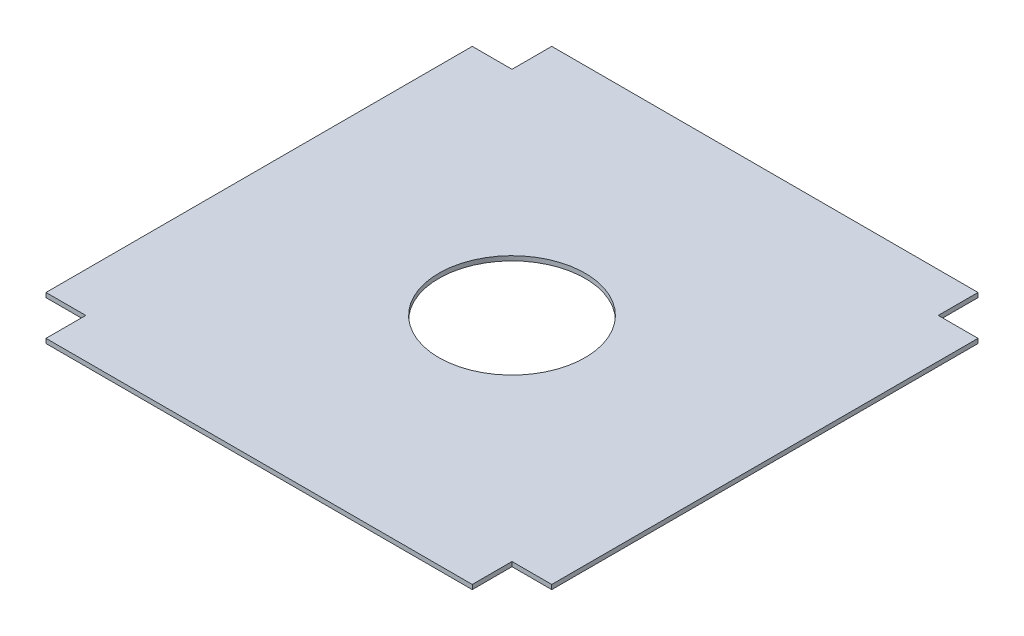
ISO-10303-21;
HEADER;
FILE_DESCRIPTION(('STEP AP214'),'2;1');
FILE_NAME('part.step','',(''),(''),'','','');
FILE_SCHEMA(('AUTOMOTIVE_DESIGN { 1 0 10303 214 1 1 1 1 }'));
ENDSEC;
DATA;
#1=APPLICATION_CONTEXT('core data for automotive mechanical design processes');
#2=APPLICATION_PROTOCOL_DEFINITION('international standard','automotive_design',2000,#1);
#3=PRODUCT_CONTEXT('',#1,'mechanical');
#4=PRODUCT('Part','Part','',(#3));
#5=PRODUCT_RELATED_PRODUCT_CATEGORY('part','',(#4));
#6=PRODUCT_DEFINITION_FORMATION('','',#4);
#7=PRODUCT_DEFINITION_CONTEXT('part definition',#1,'design');
#8=PRODUCT_DEFINITION('design','',#6,#7);
#9=PRODUCT_DEFINITION_SHAPE('','',#8);
#10=(LENGTH_UNIT() NAMED_UNIT(*) SI_UNIT(.MILLI.,.METRE.));
#11=(NAMED_UNIT(*) PLANE_ANGLE_UNIT() SI_UNIT($,.RADIAN.));
#12=(NAMED_UNIT(*) SI_UNIT($,.STERADIAN.) SOLID_ANGLE_UNIT());
#13=UNCERTAINTY_MEASURE_WITH_UNIT(LENGTH_MEASURE(1.E-05),#10,'distance_accuracy_value','');
#14=(GEOMETRIC_REPRESENTATION_CONTEXT(3) GLOBAL_UNCERTAINTY_ASSIGNED_CONTEXT((#13)) GLOBAL_UNIT_ASSIGNED_CONTEXT((#10,
#11,#12)) REPRESENTATION_CONTEXT('',''));
#15=CARTESIAN_POINT('',(0.,0.,0.));
#16=DIRECTION('',(0.,0.,1.));
#17=DIRECTION('',(1.,0.,0.));
#18=AXIS2_PLACEMENT_3D('',#15,#16,#17);
#19=CARTESIAN_POINT('',(-177.8,3.175,0.));
#20=DIRECTION('',(1.,0.,0.));
#21=DIRECTION('',(0.,0.,-1.));
#22=AXIS2_PLACEMENT_3D('',#19,#20,#21);
#23=PLANE('',#22);
#24=DIRECTION('',(0.,0.,1.));
#25=VECTOR('',#24,1.);
#26=CARTESIAN_POINT('',(-177.8,0.,0.));
#27=LINE('',#26,#25);
#28=CARTESIAN_POINT('',(-177.8,0.,-149.86));
#29=VERTEX_POINT('',#28);
#30=CARTESIAN_POINT('',(-177.8,0.,149.86));
#31=VERTEX_POINT('',#30);
#32=EDGE_CURVE('E160',#29,#31,#27,.T.);
#33=ORIENTED_EDGE('',*,*,#32,.T.);
#34=DIRECTION('',(0.,-1.,0.));
#35=VECTOR('',#34,1.);
#36=CARTESIAN_POINT('',(-177.8,3.175,149.86));
#37=LINE('',#36,#35);
#38=CARTESIAN_POINT('',(-177.8,3.175,149.86));
#39=VERTEX_POINT('',#38);
#40=EDGE_CURVE('E11',#39,#31,#37,.T.);
#41=ORIENTED_EDGE('',*,*,#40,.F.);
#42=DIRECTION('',(0.,0.,1.));
#43=VECTOR('',#42,1.);
#44=CARTESIAN_POINT('',(-177.8,3.175,0.));
#45=LINE('',#44,#43);
#46=CARTESIAN_POINT('',(-177.8,3.175,-149.86));
#47=VERTEX_POINT('',#46);
#48=EDGE_CURVE('E378',#47,#39,#45,.T.);
#49=ORIENTED_EDGE('',*,*,#48,.F.);
#50=DIRECTION('',(0.,-1.,0.));
#51=VECTOR('',#50,1.);
#52=CARTESIAN_POINT('',(-177.8,3.175,-149.86));
#53=LINE('',#52,#51);
#54=EDGE_CURVE('E51',#47,#29,#53,.T.);
#55=ORIENTED_EDGE('',*,*,#54,.T.);
#56=EDGE_LOOP('',(#33,#41,#49,#55));
#57=FACE_BOUND('',#56,.T.);
#58=ADVANCED_FACE('F34',(#57),#23,.F.);
#59=CARTESIAN_POINT('',(0.,3.175,149.86));
#60=DIRECTION('',(0.,0.,-1.));
#61=DIRECTION('',(-1.,0.,0.));
#62=AXIS2_PLACEMENT_3D('',#59,#60,#61);
#63=PLANE('',#62);
#64=DIRECTION('',(1.,0.,0.));
#65=VECTOR('',#64,1.);
#66=CARTESIAN_POINT('',(0.,0.,149.86));
#67=LINE('',#66,#65);
#68=CARTESIAN_POINT('',(-149.86,0.,149.86));
#69=VERTEX_POINT('',#68);
#70=EDGE_CURVE('E162',#31,#69,#67,.T.);
#71=ORIENTED_EDGE('',*,*,#70,.T.);
#72=DIRECTION('',(0.,-1.,0.));
#73=VECTOR('',#72,1.);
#74=CARTESIAN_POINT('',(-149.86,3.175,149.86));
#75=LINE('',#74,#73);
#76=CARTESIAN_POINT('',(-149.86,3.175,149.86));
#77=VERTEX_POINT('',#76);
#78=EDGE_CURVE('E43',#77,#69,#75,.T.);
#79=ORIENTED_EDGE('',*,*,#78,.F.);
#80=DIRECTION('',(1.,0.,0.));
#81=VECTOR('',#80,1.);
#82=CARTESIAN_POINT('',(0.,3.175,149.86));
#83=LINE('',#82,#81);
#84=EDGE_CURVE('E102',#39,#77,#83,.T.);
#85=ORIENTED_EDGE('',*,*,#84,.F.);
#86=ORIENTED_EDGE('',*,*,#40,.T.);
#87=EDGE_LOOP('',(#71,#79,#85,#86));
#88=FACE_BOUND('',#87,.T.);
#89=ADVANCED_FACE('F213',(#88),#63,.F.);
#90=CARTESIAN_POINT('',(-149.86,3.175,0.));
#91=DIRECTION('',(-1.,0.,0.));
#92=DIRECTION('',(0.,0.,1.));
#93=AXIS2_PLACEMENT_3D('',#90,#91,#92);
#94=PLANE('',#93);
#95=DIRECTION('',(0.,0.,-1.));
#96=VECTOR('',#95,1.);
#97=CARTESIAN_POINT('',(-149.86,0.,0.));
#98=LINE('',#97,#96);
#99=CARTESIAN_POINT('',(-149.86,0.,177.8));
#100=VERTEX_POINT('',#99);
#101=EDGE_CURVE('E165',#100,#69,#98,.T.);
#102=ORIENTED_EDGE('',*,*,#101,.F.);
#103=DIRECTION('',(0.,-1.,0.));
#104=VECTOR('',#103,1.);
#105=CARTESIAN_POINT('',(-149.86,3.175,177.8));
#106=LINE('',#105,#104);
#107=CARTESIAN_POINT('',(-149.86,3.175,177.8));
#108=VERTEX_POINT('',#107);
#109=EDGE_CURVE('E206',#108,#100,#106,.T.);
#110=ORIENTED_EDGE('',*,*,#109,.F.);
#111=DIRECTION('',(0.,0.,-1.));
#112=VECTOR('',#111,1.);
#113=CARTESIAN_POINT('',(-149.86,3.175,0.));
#114=LINE('',#113,#112);
#115=EDGE_CURVE('E212',#108,#77,#114,.T.);
#116=ORIENTED_EDGE('',*,*,#115,.T.);
#117=ORIENTED_EDGE('',*,*,#78,.T.);
#118=EDGE_LOOP('',(#102,#110,#116,#117));
#119=FACE_BOUND('',#118,.T.);
#120=ADVANCED_FACE('F210',(#119),#94,.T.);
#121=CARTESIAN_POINT('',(0.,3.175,177.8));
#122=DIRECTION('',(0.,0.,-1.));
#123=DIRECTION('',(-1.,0.,0.));
#124=AXIS2_PLACEMENT_3D('',#121,#122,#123);
#125=PLANE('',#124);
#126=DIRECTION('',(1.,0.,0.));
#127=VECTOR('',#126,1.);
#128=CARTESIAN_POINT('',(0.,0.,177.8));
#129=LINE('',#128,#127);
#130=CARTESIAN_POINT('',(149.86,0.,177.8));
#131=VERTEX_POINT('',#130);
#132=EDGE_CURVE('E168',#100,#131,#129,.T.);
#133=ORIENTED_EDGE('',*,*,#132,.T.);
#134=DIRECTION('',(0.,-1.,0.));
#135=VECTOR('',#134,1.);
#136=CARTESIAN_POINT('',(149.86,3.175,177.8));
#137=LINE('',#136,#135);
#138=CARTESIAN_POINT('',(149.86,3.175,177.8));
#139=VERTEX_POINT('',#138);
#140=EDGE_CURVE('E203',#139,#131,#137,.T.);
#141=ORIENTED_EDGE('',*,*,#140,.F.);
#142=DIRECTION('',(1.,0.,0.));
#143=VECTOR('',#142,1.);
#144=CARTESIAN_POINT('',(0.,3.175,177.8));
#145=LINE('',#144,#143);
#146=EDGE_CURVE('E231',#108,#139,#145,.T.);
#147=ORIENTED_EDGE('',*,*,#146,.F.);
#148=ORIENTED_EDGE('',*,*,#109,.T.);
#149=EDGE_LOOP('',(#133,#141,#147,#148));
#150=FACE_BOUND('',#149,.T.);
#151=ADVANCED_FACE('F221',(#150),#125,.F.);
#152=CARTESIAN_POINT('',(149.86,3.175,0.));
#153=DIRECTION('',(-1.,0.,0.));
#154=DIRECTION('',(0.,0.,1.));
#155=AXIS2_PLACEMENT_3D('',#152,#153,#154);
#156=PLANE('',#155);
#157=DIRECTION('',(0.,0.,-1.));
#158=VECTOR('',#157,1.);
#159=CARTESIAN_POINT('',(149.86,0.,0.));
#160=LINE('',#159,#158);
#161=CARTESIAN_POINT('',(149.86,0.,149.86));
#162=VERTEX_POINT('',#161);
#163=EDGE_CURVE('E170',#131,#162,#160,.T.);
#164=ORIENTED_EDGE('',*,*,#163,.T.);
#165=DIRECTION('',(0.,-1.,0.));
#166=VECTOR('',#165,1.);
#167=CARTESIAN_POINT('',(149.86,3.175,149.86));
#168=LINE('',#167,#166);
#169=CARTESIAN_POINT('',(149.86,3.175,149.86));
#170=VERTEX_POINT('',#169);
#171=EDGE_CURVE('E201',#170,#162,#168,.T.);
#172=ORIENTED_EDGE('',*,*,#171,.F.);
#173=DIRECTION('',(0.,0.,-1.));
#174=VECTOR('',#173,1.);
#175=CARTESIAN_POINT('',(149.86,3.175,0.));
#176=LINE('',#175,#174);
#177=EDGE_CURVE('E227',#139,#170,#176,.T.);
#178=ORIENTED_EDGE('',*,*,#177,.F.);
#179=ORIENTED_EDGE('',*,*,#140,.T.);
#180=EDGE_LOOP('',(#164,#172,#178,#179));
#181=FACE_BOUND('',#180,.T.);
#182=ADVANCED_FACE('F225',(#181),#156,.F.);
#183=CARTESIAN_POINT('',(-1.48870814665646E-13,3.175,149.86));
#184=DIRECTION('',(0.,0.,1.));
#185=DIRECTION('',(1.,0.,0.));
#186=AXIS2_PLACEMENT_3D('',#183,#184,#185);
#187=PLANE('',#186);
#188=DIRECTION('',(-1.,0.,0.));
#189=VECTOR('',#188,1.);
#190=CARTESIAN_POINT('',(-1.48870814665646E-13,0.,149.86));
#191=LINE('',#190,#189);
#192=CARTESIAN_POINT('',(177.8,0.,149.86));
#193=VERTEX_POINT('',#192);
#194=EDGE_CURVE('E173',#193,#162,#191,.T.);
#195=ORIENTED_EDGE('',*,*,#194,.F.);
#196=DIRECTION('',(0.,-1.,0.));
#197=VECTOR('',#196,1.);
#198=CARTESIAN_POINT('',(177.8,3.175,149.86));
#199=LINE('',#198,#197);
#200=CARTESIAN_POINT('',(177.8,3.175,149.86));
#201=VERTEX_POINT('',#200);
#202=EDGE_CURVE('E199',#201,#193,#199,.T.);
#203=ORIENTED_EDGE('',*,*,#202,.F.);
#204=DIRECTION('',(-1.,0.,0.));
#205=VECTOR('',#204,1.);
#206=CARTESIAN_POINT('',(-1.48870814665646E-13,3.175,149.86));
#207=LINE('',#206,#205);
#208=EDGE_CURVE('E230',#201,#170,#207,.T.);
#209=ORIENTED_EDGE('',*,*,#208,.T.);
#210=ORIENTED_EDGE('',*,*,#171,.T.);
#211=EDGE_LOOP('',(#195,#203,#209,#210));
#212=FACE_BOUND('',#211,.T.);
#213=ADVANCED_FACE('F272',(#212),#187,.T.);
#214=CARTESIAN_POINT('',(177.8,3.175,0.));
#215=DIRECTION('',(1.,0.,0.));
#216=DIRECTION('',(0.,0.,-1.));
#217=AXIS2_PLACEMENT_3D('',#214,#215,#216);
#218=PLANE('',#217);
#219=DIRECTION('',(0.,0.,1.));
#220=VECTOR('',#219,1.);
#221=CARTESIAN_POINT('',(177.8,0.,0.));
#222=LINE('',#221,#220);
#223=CARTESIAN_POINT('',(177.8,0.,-149.86));
#224=VERTEX_POINT('',#223);
#225=EDGE_CURVE('E176',#224,#193,#222,.T.);
#226=ORIENTED_EDGE('',*,*,#225,.F.);
#227=DIRECTION('',(0.,-1.,0.));
#228=VECTOR('',#227,1.);
#229=CARTESIAN_POINT('',(177.8,3.175,-149.86));
#230=LINE('',#229,#228);
#231=CARTESIAN_POINT('',(177.8,3.175,-149.86));
#232=VERTEX_POINT('',#231);
#233=EDGE_CURVE('E197',#232,#224,#230,.T.);
#234=ORIENTED_EDGE('',*,*,#233,.F.);
#235=DIRECTION('',(0.,0.,1.));
#236=VECTOR('',#235,1.);
#237=CARTESIAN_POINT('',(177.8,3.175,0.));
#238=LINE('',#237,#236);
#239=EDGE_CURVE('E233',#232,#201,#238,.T.);
#240=ORIENTED_EDGE('',*,*,#239,.T.);
#241=ORIENTED_EDGE('',*,*,#202,.T.);
#242=EDGE_LOOP('',(#226,#234,#240,#241));
#243=FACE_BOUND('',#242,.T.);
#244=ADVANCED_FACE('F275',(#243),#218,.T.);
#245=CARTESIAN_POINT('',(-1.48870814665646E-13,3.175,-149.86));
#246=DIRECTION('',(0.,0.,1.));
#247=DIRECTION('',(1.,0.,0.));
#248=AXIS2_PLACEMENT_3D('',#245,#246,#247);
#249=PLANE('',#248);
#250=DIRECTION('',(-1.,0.,0.));
#251=VECTOR('',#250,1.);
#252=CARTESIAN_POINT('',(-1.48870814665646E-13,0.,-149.86));
#253=LINE('',#252,#251);
#254=CARTESIAN_POINT('',(149.86,0.,-149.86));
#255=VERTEX_POINT('',#254);
#256=EDGE_CURVE('E179',#224,#255,#253,.T.);
#257=ORIENTED_EDGE('',*,*,#256,.T.);
#258=DIRECTION('',(0.,-1.,0.));
#259=VECTOR('',#258,1.);
#260=CARTESIAN_POINT('',(149.86,3.175,-149.86));
#261=LINE('',#260,#259);
#262=CARTESIAN_POINT('',(149.86,3.175,-149.86));
#263=VERTEX_POINT('',#262);
#264=EDGE_CURVE('E195',#263,#255,#261,.T.);
#265=ORIENTED_EDGE('',*,*,#264,.F.);
#266=DIRECTION('',(-1.,0.,0.));
#267=VECTOR('',#266,1.);
#268=CARTESIAN_POINT('',(-1.48870814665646E-13,3.175,-149.86));
#269=LINE('',#268,#267);
#270=EDGE_CURVE('E152',#232,#263,#269,.T.);
#271=ORIENTED_EDGE('',*,*,#270,.F.);
#272=ORIENTED_EDGE('',*,*,#233,.T.);
#273=EDGE_LOOP('',(#257,#265,#271,#272));
#274=FACE_BOUND('',#273,.T.);
#275=ADVANCED_FACE('F243',(#274),#249,.F.);
#276=CARTESIAN_POINT('',(149.86,3.175,0.));
#277=DIRECTION('',(1.,0.,0.));
#278=DIRECTION('',(0.,0.,-1.));
#279=AXIS2_PLACEMENT_3D('',#276,#277,#278);
#280=PLANE('',#279);
#281=DIRECTION('',(0.,0.,1.));
#282=VECTOR('',#281,1.);
#283=CARTESIAN_POINT('',(149.86,0.,0.));
#284=LINE('',#283,#282);
#285=CARTESIAN_POINT('',(149.86,0.,-177.8));
#286=VERTEX_POINT('',#285);
#287=EDGE_CURVE('E182',#286,#255,#284,.T.);
#288=ORIENTED_EDGE('',*,*,#287,.F.);
#289=DIRECTION('',(0.,-1.,0.));
#290=VECTOR('',#289,1.);
#291=CARTESIAN_POINT('',(149.86,3.175,-177.8));
#292=LINE('',#291,#290);
#293=CARTESIAN_POINT('',(149.86,3.175,-177.8));
#294=VERTEX_POINT('',#293);
#295=EDGE_CURVE('E139',#294,#286,#292,.T.);
#296=ORIENTED_EDGE('',*,*,#295,.F.);
#297=DIRECTION('',(0.,0.,1.));
#298=VECTOR('',#297,1.);
#299=CARTESIAN_POINT('',(149.86,3.175,0.));
#300=LINE('',#299,#298);
#301=EDGE_CURVE('E150',#294,#263,#300,.T.);
#302=ORIENTED_EDGE('',*,*,#301,.T.);
#303=ORIENTED_EDGE('',*,*,#264,.T.);
#304=EDGE_LOOP('',(#288,#296,#302,#303));
#305=FACE_BOUND('',#304,.T.);
#306=ADVANCED_FACE('F247',(#305),#280,.T.);
#307=CARTESIAN_POINT('',(0.,3.175,-177.8));
#308=DIRECTION('',(0.,0.,-1.));
#309=DIRECTION('',(-1.,0.,0.));
#310=AXIS2_PLACEMENT_3D('',#307,#308,#309);
#311=PLANE('',#310);
#312=DIRECTION('',(1.,0.,0.));
#313=VECTOR('',#312,1.);
#314=CARTESIAN_POINT('',(0.,0.,-177.8));
#315=LINE('',#314,#313);
#316=CARTESIAN_POINT('',(-149.86,0.,-177.8));
#317=VERTEX_POINT('',#316);
#318=EDGE_CURVE('E136',#317,#286,#315,.T.);
#319=ORIENTED_EDGE('',*,*,#318,.F.);
#320=DIRECTION('',(0.,-1.,0.));
#321=VECTOR('',#320,1.);
#322=CARTESIAN_POINT('',(-149.86,3.175,-177.8));
#323=LINE('',#322,#321);
#324=CARTESIAN_POINT('',(-149.86,3.175,-177.8));
#325=VERTEX_POINT('',#324);
#326=EDGE_CURVE('E130',#325,#317,#323,.T.);
#327=ORIENTED_EDGE('',*,*,#326,.F.);
#328=DIRECTION('',(1.,0.,0.));
#329=VECTOR('',#328,1.);
#330=CARTESIAN_POINT('',(0.,3.175,-177.8));
#331=LINE('',#330,#329);
#332=EDGE_CURVE('E134',#325,#294,#331,.T.);
#333=ORIENTED_EDGE('',*,*,#332,.T.);
#334=ORIENTED_EDGE('',*,*,#295,.T.);
#335=EDGE_LOOP('',(#319,#327,#333,#334));
#336=FACE_BOUND('',#335,.T.);
#337=ADVANCED_FACE('F132',(#336),#311,.T.);
#338=CARTESIAN_POINT('',(-149.86,3.175,0.));
#339=DIRECTION('',(1.,0.,0.));
#340=DIRECTION('',(0.,0.,-1.));
#341=AXIS2_PLACEMENT_3D('',#338,#339,#340);
#342=PLANE('',#341);
#343=DIRECTION('',(0.,0.,1.));
#344=VECTOR('',#343,1.);
#345=CARTESIAN_POINT('',(-149.86,0.,0.));
#346=LINE('',#345,#344);
#347=CARTESIAN_POINT('',(-149.86,0.,-149.86));
#348=VERTEX_POINT('',#347);
#349=EDGE_CURVE('E186',#317,#348,#346,.T.);
#350=ORIENTED_EDGE('',*,*,#349,.T.);
#351=DIRECTION('',(0.,-1.,0.));
#352=VECTOR('',#351,1.);
#353=CARTESIAN_POINT('',(-149.86,3.175,-149.86));
#354=LINE('',#353,#352);
#355=CARTESIAN_POINT('',(-149.86,3.175,-149.86));
#356=VERTEX_POINT('',#355);
#357=EDGE_CURVE('E90',#356,#348,#354,.T.);
#358=ORIENTED_EDGE('',*,*,#357,.F.);
#359=DIRECTION('',(0.,0.,1.));
#360=VECTOR('',#359,1.);
#361=CARTESIAN_POINT('',(-149.86,3.175,0.));
#362=LINE('',#361,#360);
#363=EDGE_CURVE('E141',#325,#356,#362,.T.);
#364=ORIENTED_EDGE('',*,*,#363,.F.);
#365=ORIENTED_EDGE('',*,*,#326,.T.);
#366=EDGE_LOOP('',(#350,#358,#364,#365));
#367=FACE_BOUND('',#366,.T.);
#368=ADVANCED_FACE('F142',(#367),#342,.F.);
#369=CARTESIAN_POINT('',(0.,3.175,0.));
#370=DIRECTION('',(0.,-1.,0.));
#371=DIRECTION('',(0.,0.,-1.));
#372=AXIS2_PLACEMENT_3D('',#369,#370,#371);
#373=CYLINDRICAL_SURFACE('',#372,51.435);
#374=CARTESIAN_POINT('',(0.,3.175,0.));
#375=DIRECTION('',(0.,1.,0.));
#376=DIRECTION('',(0.,0.,1.));
#377=AXIS2_PLACEMENT_3D('',#374,#375,#376);
#378=CIRCLE('',#377,51.435);
#379=CARTESIAN_POINT('',(0.,3.175,51.435));
#380=VERTEX_POINT('',#379);
#381=EDGE_CURVE('E191',#380,#380,#378,.T.);
#382=ORIENTED_EDGE('',*,*,#381,.T.);
#383=EDGE_LOOP('',(#382));
#384=FACE_BOUND('',#383,.T.);
#385=CARTESIAN_POINT('',(0.,0.,0.));
#386=DIRECTION('',(0.,1.,0.));
#387=DIRECTION('',(0.,0.,1.));
#388=AXIS2_PLACEMENT_3D('',#385,#386,#387);
#389=CIRCLE('',#388,51.435);
#390=CARTESIAN_POINT('',(0.,0.,51.435));
#391=VERTEX_POINT('',#390);
#392=EDGE_CURVE('E157',#391,#391,#389,.T.);
#393=ORIENTED_EDGE('',*,*,#392,.F.);
#394=EDGE_LOOP('',(#393));
#395=FACE_BOUND('',#394,.T.);
#396=ADVANCED_FACE('F36',(#384,#395),#373,.F.);
#397=CARTESIAN_POINT('',(0.,3.175,-149.86));
#398=DIRECTION('',(0.,0.,-1.));
#399=DIRECTION('',(-1.,0.,0.));
#400=AXIS2_PLACEMENT_3D('',#397,#398,#399);
#401=PLANE('',#400);
#402=DIRECTION('',(1.,0.,0.));
#403=VECTOR('',#402,1.);
#404=CARTESIAN_POINT('',(0.,0.,-149.86));
#405=LINE('',#404,#403);
#406=EDGE_CURVE('E188',#29,#348,#405,.T.);
#407=ORIENTED_EDGE('',*,*,#406,.F.);
#408=ORIENTED_EDGE('',*,*,#54,.F.);
#409=DIRECTION('',(1.,0.,0.));
#410=VECTOR('',#409,1.);
#411=CARTESIAN_POINT('',(0.,3.175,-149.86));
#412=LINE('',#411,#410);
#413=EDGE_CURVE('E145',#47,#356,#412,.T.);
#414=ORIENTED_EDGE('',*,*,#413,.T.);
#415=ORIENTED_EDGE('',*,*,#357,.T.);
#416=EDGE_LOOP('',(#407,#408,#414,#415));
#417=FACE_BOUND('',#416,.T.);
#418=ADVANCED_FACE('F248',(#417),#401,.T.);
#419=CARTESIAN_POINT('',(0.,3.175,0.));
#420=DIRECTION('',(0.,1.,0.));
#421=DIRECTION('',(0.,0.,1.));
#422=AXIS2_PLACEMENT_3D('',#419,#420,#421);
#423=PLANE('',#422);
#424=ORIENTED_EDGE('',*,*,#381,.F.);
#425=EDGE_LOOP('',(#424));
#426=FACE_BOUND('',#425,.T.);
#427=ORIENTED_EDGE('',*,*,#48,.T.);
#428=ORIENTED_EDGE('',*,*,#84,.T.);
#429=ORIENTED_EDGE('',*,*,#115,.F.);
#430=ORIENTED_EDGE('',*,*,#146,.T.);
#431=ORIENTED_EDGE('',*,*,#177,.T.);
#432=ORIENTED_EDGE('',*,*,#208,.F.);
#433=ORIENTED_EDGE('',*,*,#239,.F.);
#434=ORIENTED_EDGE('',*,*,#270,.T.);
#435=ORIENTED_EDGE('',*,*,#301,.F.);
#436=ORIENTED_EDGE('',*,*,#332,.F.);
#437=ORIENTED_EDGE('',*,*,#363,.T.);
#438=ORIENTED_EDGE('',*,*,#413,.F.);
#439=EDGE_LOOP('',(#427,#428,#429,#430,#431,#432,#433,#434,#435,#436,#437,#438));
#440=FACE_BOUND('',#439,.T.);
#441=ADVANCED_FACE('F148',(#426,#440),#423,.T.);
#442=CARTESIAN_POINT('',(0.,0.,0.));
#443=DIRECTION('',(0.,1.,0.));
#444=DIRECTION('',(0.,0.,1.));
#445=AXIS2_PLACEMENT_3D('',#442,#443,#444);
#446=PLANE('',#445);
#447=ORIENTED_EDGE('',*,*,#392,.T.);
#448=EDGE_LOOP('',(#447));
#449=FACE_BOUND('',#448,.T.);
#450=ORIENTED_EDGE('',*,*,#32,.F.);
#451=ORIENTED_EDGE('',*,*,#406,.T.);
#452=ORIENTED_EDGE('',*,*,#349,.F.);
#453=ORIENTED_EDGE('',*,*,#318,.T.);
#454=ORIENTED_EDGE('',*,*,#287,.T.);
#455=ORIENTED_EDGE('',*,*,#256,.F.);
#456=ORIENTED_EDGE('',*,*,#225,.T.);
#457=ORIENTED_EDGE('',*,*,#194,.T.);
#458=ORIENTED_EDGE('',*,*,#163,.F.);
#459=ORIENTED_EDGE('',*,*,#132,.F.);
#460=ORIENTED_EDGE('',*,*,#101,.T.);
#461=ORIENTED_EDGE('',*,*,#70,.F.);
#462=EDGE_LOOP('',(#450,#451,#452,#453,#454,#455,#456,#457,#458,#459,#460,#461));
#463=FACE_BOUND('',#462,.T.);
#464=ADVANCED_FACE('F217',(#449,#463),#446,.F.);
#465=CLOSED_SHELL('',(#58,#89,#120,#151,#182,#213,#244,#275,#306,#337,#368,#396,#418,#441,#464));
#466=MANIFOLD_SOLID_BREP('B2',#465);
#467=ADVANCED_BREP_SHAPE_REPRESENTATION('',(#18,#466),#14);
#468=SHAPE_DEFINITION_REPRESENTATION(#9,#467);
ENDSEC;
END-ISO-10303-21;
